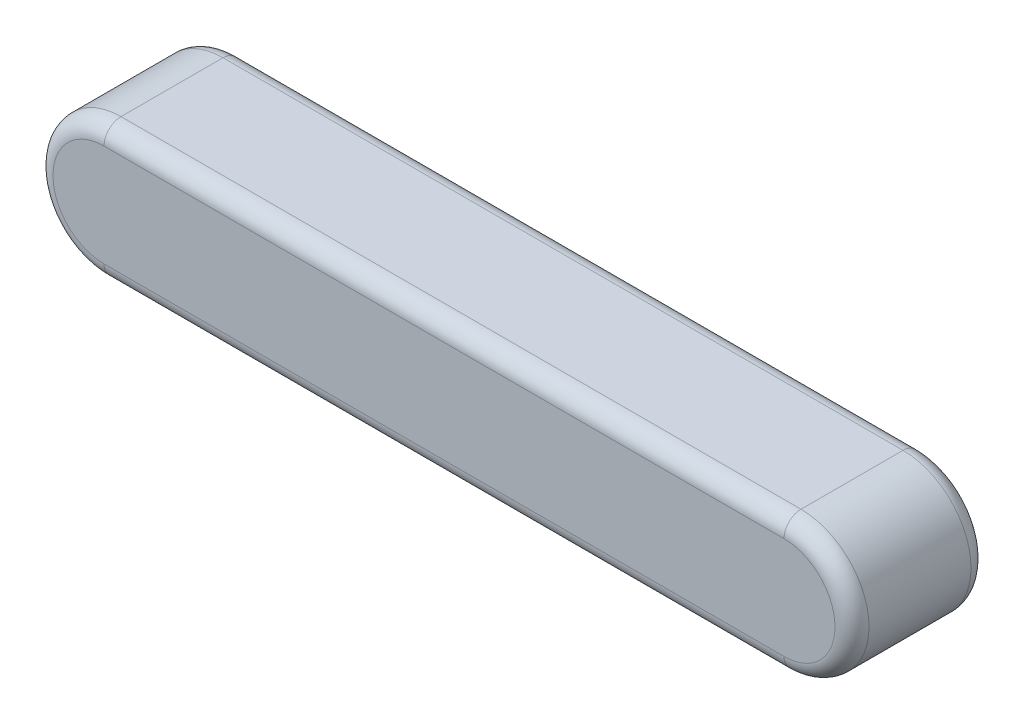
ISO-10303-21;
HEADER;
FILE_DESCRIPTION(('STEP AP214'),'2;1');
FILE_NAME('part.step','',(''),(''),'','','');
FILE_SCHEMA(('AUTOMOTIVE_DESIGN { 1 0 10303 214 1 1 1 1 }'));
ENDSEC;
DATA;
#1=APPLICATION_CONTEXT('core data for automotive mechanical design processes');
#2=APPLICATION_PROTOCOL_DEFINITION('international standard','automotive_design',2000,#1);
#3=PRODUCT_CONTEXT('',#1,'mechanical');
#4=PRODUCT('Part','Part','',(#3));
#5=PRODUCT_RELATED_PRODUCT_CATEGORY('part','',(#4));
#6=PRODUCT_DEFINITION_FORMATION('','',#4);
#7=PRODUCT_DEFINITION_CONTEXT('part definition',#1,'design');
#8=PRODUCT_DEFINITION('design','',#6,#7);
#9=PRODUCT_DEFINITION_SHAPE('','',#8);
#10=(LENGTH_UNIT() NAMED_UNIT(*) SI_UNIT(.MILLI.,.METRE.));
#11=(NAMED_UNIT(*) PLANE_ANGLE_UNIT() SI_UNIT($,.RADIAN.));
#12=(NAMED_UNIT(*) SI_UNIT($,.STERADIAN.) SOLID_ANGLE_UNIT());
#13=UNCERTAINTY_MEASURE_WITH_UNIT(LENGTH_MEASURE(1.E-05),#10,'distance_accuracy_value','');
#14=(GEOMETRIC_REPRESENTATION_CONTEXT(3) GLOBAL_UNCERTAINTY_ASSIGNED_CONTEXT((#13)) GLOBAL_UNIT_ASSIGNED_CONTEXT((#10,
#11,#12)) REPRESENTATION_CONTEXT('',''));
#15=CARTESIAN_POINT('',(0.,0.,0.));
#16=DIRECTION('',(0.,0.,1.));
#17=DIRECTION('',(1.,0.,0.));
#18=AXIS2_PLACEMENT_3D('',#15,#16,#17);
#19=CARTESIAN_POINT('',(-5.,0.,2.));
#20=DIRECTION('',(0.,0.,-1.));
#21=DIRECTION('',(-1.,0.,0.));
#22=AXIS2_PLACEMENT_3D('',#19,#20,#21);
#23=CYLINDRICAL_SURFACE('',#22,1.);
#24=DIRECTION('',(0.,0.,-1.));
#25=VECTOR('',#24,1.);
#26=CARTESIAN_POINT('',(-5.,-1.,2.));
#27=LINE('',#26,#25);
#28=CARTESIAN_POINT('',(-5.,-1.,1.75));
#29=VERTEX_POINT('',#28);
#30=CARTESIAN_POINT('',(-5.,-1.,0.25));
#31=VERTEX_POINT('',#30);
#32=EDGE_CURVE('E123',#29,#31,#27,.T.);
#33=ORIENTED_EDGE('',*,*,#32,.F.);
#34=CARTESIAN_POINT('',(-5.,0.,1.75));
#35=DIRECTION('',(0.,0.,1.));
#36=DIRECTION('',(1.,0.,0.));
#37=AXIS2_PLACEMENT_3D('',#34,#35,#36);
#38=CIRCLE('',#37,1.);
#39=CARTESIAN_POINT('',(-5.,1.,1.75));
#40=VERTEX_POINT('',#39);
#41=EDGE_CURVE('E59',#29,#40,#38,.F.);
#42=ORIENTED_EDGE('',*,*,#41,.T.);
#43=DIRECTION('',(0.,0.,-1.));
#44=VECTOR('',#43,1.);
#45=CARTESIAN_POINT('',(-5.,1.,2.));
#46=LINE('',#45,#44);
#47=CARTESIAN_POINT('',(-5.,1.,0.25));
#48=VERTEX_POINT('',#47);
#49=EDGE_CURVE('E159',#40,#48,#46,.T.);
#50=ORIENTED_EDGE('',*,*,#49,.T.);
#51=CARTESIAN_POINT('',(-5.,0.,0.25));
#52=DIRECTION('',(0.,0.,1.));
#53=DIRECTION('',(1.,0.,0.));
#54=AXIS2_PLACEMENT_3D('',#51,#52,#53);
#55=CIRCLE('',#54,1.);
#56=EDGE_CURVE('E150',#48,#31,#55,.T.);
#57=ORIENTED_EDGE('',*,*,#56,.T.);
#58=EDGE_LOOP('',(#33,#42,#50,#57));
#59=FACE_BOUND('',#58,.T.);
#60=ADVANCED_FACE('F36',(#59),#23,.T.);
#61=CARTESIAN_POINT('',(-5.,-1.,2.));
#62=DIRECTION('',(0.,1.,0.));
#63=DIRECTION('',(-1.,0.,0.));
#64=AXIS2_PLACEMENT_3D('',#61,#62,#63);
#65=PLANE('',#64);
#66=DIRECTION('',(0.,0.,-1.));
#67=VECTOR('',#66,1.);
#68=CARTESIAN_POINT('',(5.,-0.999999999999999,2.));
#69=LINE('',#68,#67);
#70=CARTESIAN_POINT('',(5.,-0.999999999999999,1.75));
#71=VERTEX_POINT('',#70);
#72=CARTESIAN_POINT('',(5.,-0.999999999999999,0.25));
#73=VERTEX_POINT('',#72);
#74=EDGE_CURVE('E192',#71,#73,#69,.T.);
#75=ORIENTED_EDGE('',*,*,#74,.F.);
#76=DIRECTION('',(1.,0.,0.));
#77=VECTOR('',#76,1.);
#78=CARTESIAN_POINT('',(-5.,-1.,1.75));
#79=LINE('',#78,#77);
#80=EDGE_CURVE('E148',#71,#29,#79,.F.);
#81=ORIENTED_EDGE('',*,*,#80,.T.);
#82=ORIENTED_EDGE('',*,*,#32,.T.);
#83=DIRECTION('',(1.,0.,0.));
#84=VECTOR('',#83,1.);
#85=CARTESIAN_POINT('',(-5.,-1.,0.25));
#86=LINE('',#85,#84);
#87=EDGE_CURVE('E146',#31,#73,#86,.T.);
#88=ORIENTED_EDGE('',*,*,#87,.T.);
#89=EDGE_LOOP('',(#75,#81,#82,#88));
#90=FACE_BOUND('',#89,.T.);
#91=ADVANCED_FACE('F206',(#90),#65,.F.);
#92=CARTESIAN_POINT('',(5.,0.,2.));
#93=DIRECTION('',(0.,0.,-1.));
#94=DIRECTION('',(-1.,0.,0.));
#95=AXIS2_PLACEMENT_3D('',#92,#93,#94);
#96=CYLINDRICAL_SURFACE('',#95,1.);
#97=DIRECTION('',(0.,0.,-1.));
#98=VECTOR('',#97,1.);
#99=CARTESIAN_POINT('',(5.,1.,2.));
#100=LINE('',#99,#98);
#101=CARTESIAN_POINT('',(5.,1.,1.75));
#102=VERTEX_POINT('',#101);
#103=CARTESIAN_POINT('',(5.,1.,0.25));
#104=VERTEX_POINT('',#103);
#105=EDGE_CURVE('E190',#102,#104,#100,.T.);
#106=ORIENTED_EDGE('',*,*,#105,.F.);
#107=CARTESIAN_POINT('',(5.,0.,1.75));
#108=DIRECTION('',(0.,0.,1.));
#109=DIRECTION('',(1.,0.,0.));
#110=AXIS2_PLACEMENT_3D('',#107,#108,#109);
#111=CIRCLE('',#110,1.);
#112=EDGE_CURVE('E110',#102,#71,#111,.F.);
#113=ORIENTED_EDGE('',*,*,#112,.T.);
#114=ORIENTED_EDGE('',*,*,#74,.T.);
#115=CARTESIAN_POINT('',(5.,0.,0.25));
#116=DIRECTION('',(0.,0.,1.));
#117=DIRECTION('',(1.,0.,0.));
#118=AXIS2_PLACEMENT_3D('',#115,#116,#117);
#119=CIRCLE('',#118,1.);
#120=EDGE_CURVE('E129',#73,#104,#119,.T.);
#121=ORIENTED_EDGE('',*,*,#120,.T.);
#122=EDGE_LOOP('',(#106,#113,#114,#121));
#123=FACE_BOUND('',#122,.T.);
#124=ADVANCED_FACE('F189',(#123),#96,.T.);
#125=CARTESIAN_POINT('',(-5.,1.,2.));
#126=DIRECTION('',(0.,-1.,0.));
#127=DIRECTION('',(1.,0.,0.));
#128=AXIS2_PLACEMENT_3D('',#125,#126,#127);
#129=PLANE('',#128);
#130=ORIENTED_EDGE('',*,*,#49,.F.);
#131=DIRECTION('',(-1.,0.,0.));
#132=VECTOR('',#131,1.);
#133=CARTESIAN_POINT('',(5.,1.,1.75));
#134=LINE('',#133,#132);
#135=EDGE_CURVE('E11',#40,#102,#134,.F.);
#136=ORIENTED_EDGE('',*,*,#135,.T.);
#137=ORIENTED_EDGE('',*,*,#105,.T.);
#138=DIRECTION('',(-1.,0.,0.));
#139=VECTOR('',#138,1.);
#140=CARTESIAN_POINT('',(-5.,1.,0.25));
#141=LINE('',#140,#139);
#142=EDGE_CURVE('E45',#104,#48,#141,.T.);
#143=ORIENTED_EDGE('',*,*,#142,.T.);
#144=EDGE_LOOP('',(#130,#136,#137,#143));
#145=FACE_BOUND('',#144,.T.);
#146=ADVANCED_FACE('F193',(#145),#129,.F.);
#147=CARTESIAN_POINT('',(-5.,0.,2.));
#148=DIRECTION('',(0.,0.,1.));
#149=DIRECTION('',(1.,0.,0.));
#150=AXIS2_PLACEMENT_3D('',#147,#148,#149);
#151=PLANE('',#150);
#152=DIRECTION('',(1.,0.,0.));
#153=VECTOR('',#152,1.);
#154=CARTESIAN_POINT('',(5.,-0.750000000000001,2.));
#155=LINE('',#154,#153);
#156=CARTESIAN_POINT('',(-5.,-0.749999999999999,2.));
#157=VERTEX_POINT('',#156);
#158=CARTESIAN_POINT('',(5.,-0.750000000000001,2.));
#159=VERTEX_POINT('',#158);
#160=EDGE_CURVE('E127',#157,#159,#155,.T.);
#161=ORIENTED_EDGE('',*,*,#160,.T.);
#162=CARTESIAN_POINT('',(5.,0.,2.));
#163=DIRECTION('',(0.,0.,1.));
#164=DIRECTION('',(1.,0.,0.));
#165=AXIS2_PLACEMENT_3D('',#162,#163,#164);
#166=CIRCLE('',#165,0.750000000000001);
#167=CARTESIAN_POINT('',(5.,0.750000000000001,2.));
#168=VERTEX_POINT('',#167);
#169=EDGE_CURVE('E108',#159,#168,#166,.T.);
#170=ORIENTED_EDGE('',*,*,#169,.T.);
#171=DIRECTION('',(-1.,0.,0.));
#172=VECTOR('',#171,1.);
#173=CARTESIAN_POINT('',(-5.,0.75,2.));
#174=LINE('',#173,#172);
#175=CARTESIAN_POINT('',(-5.,0.75,2.));
#176=VERTEX_POINT('',#175);
#177=EDGE_CURVE('E116',#168,#176,#174,.T.);
#178=ORIENTED_EDGE('',*,*,#177,.T.);
#179=CARTESIAN_POINT('',(-5.,0.,2.));
#180=DIRECTION('',(0.,0.,1.));
#181=DIRECTION('',(1.,0.,0.));
#182=AXIS2_PLACEMENT_3D('',#179,#180,#181);
#183=CIRCLE('',#182,0.75);
#184=EDGE_CURVE('E122',#176,#157,#183,.T.);
#185=ORIENTED_EDGE('',*,*,#184,.T.);
#186=EDGE_LOOP('',(#161,#170,#178,#185));
#187=FACE_BOUND('',#186,.T.);
#188=ADVANCED_FACE('F125',(#187),#151,.T.);
#189=CARTESIAN_POINT('',(-5.,0.,0.));
#190=DIRECTION('',(0.,0.,1.));
#191=DIRECTION('',(1.,0.,0.));
#192=AXIS2_PLACEMENT_3D('',#189,#190,#191);
#193=PLANE('',#192);
#194=DIRECTION('',(-1.,0.,0.));
#195=VECTOR('',#194,1.);
#196=CARTESIAN_POINT('',(-5.,0.75,0.));
#197=LINE('',#196,#195);
#198=CARTESIAN_POINT('',(-5.,0.750000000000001,0.));
#199=VERTEX_POINT('',#198);
#200=CARTESIAN_POINT('',(5.,0.750000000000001,0.));
#201=VERTEX_POINT('',#200);
#202=EDGE_CURVE('E141',#199,#201,#197,.F.);
#203=ORIENTED_EDGE('',*,*,#202,.T.);
#204=CARTESIAN_POINT('',(5.,0.,0.));
#205=DIRECTION('',(0.,0.,1.));
#206=DIRECTION('',(1.,0.,0.));
#207=AXIS2_PLACEMENT_3D('',#204,#205,#206);
#208=CIRCLE('',#207,0.750000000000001);
#209=CARTESIAN_POINT('',(5.,-0.750000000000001,0.));
#210=VERTEX_POINT('',#209);
#211=EDGE_CURVE('E143',#201,#210,#208,.F.);
#212=ORIENTED_EDGE('',*,*,#211,.T.);
#213=DIRECTION('',(1.,0.,0.));
#214=VECTOR('',#213,1.);
#215=CARTESIAN_POINT('',(-5.,-0.75,0.));
#216=LINE('',#215,#214);
#217=CARTESIAN_POINT('',(-5.,-0.75,0.));
#218=VERTEX_POINT('',#217);
#219=EDGE_CURVE('E137',#210,#218,#216,.F.);
#220=ORIENTED_EDGE('',*,*,#219,.T.);
#221=CARTESIAN_POINT('',(-5.,0.,0.));
#222=DIRECTION('',(0.,0.,1.));
#223=DIRECTION('',(1.,0.,0.));
#224=AXIS2_PLACEMENT_3D('',#221,#222,#223);
#225=CIRCLE('',#224,0.75);
#226=EDGE_CURVE('E139',#218,#199,#225,.F.);
#227=ORIENTED_EDGE('',*,*,#226,.T.);
#228=EDGE_LOOP('',(#203,#212,#220,#227));
#229=FACE_BOUND('',#228,.T.);
#230=ADVANCED_FACE('F179',(#229),#193,.F.);
#231=CARTESIAN_POINT('',(-5.,0.,1.75));
#232=DIRECTION('',(0.,0.,1.));
#233=DIRECTION('',(1.,0.,0.));
#234=AXIS2_PLACEMENT_3D('',#231,#232,#233);
#235=TOROIDAL_SURFACE('',#234,0.75,0.25);
#236=CARTESIAN_POINT('',(-5.,0.750000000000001,1.75));
#237=DIRECTION('',(1.,0.,0.));
#238=DIRECTION('',(0.,0.,-1.));
#239=AXIS2_PLACEMENT_3D('',#236,#237,#238);
#240=CIRCLE('',#239,0.25);
#241=EDGE_CURVE('E119',#40,#176,#240,.T.);
#242=ORIENTED_EDGE('',*,*,#241,.F.);
#243=ORIENTED_EDGE('',*,*,#41,.F.);
#244=CARTESIAN_POINT('',(-5.,-0.749999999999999,1.75));
#245=DIRECTION('',(1.,0.,0.));
#246=DIRECTION('',(0.,0.,-1.));
#247=AXIS2_PLACEMENT_3D('',#244,#245,#246);
#248=CIRCLE('',#247,0.25);
#249=EDGE_CURVE('E156',#157,#29,#248,.T.);
#250=ORIENTED_EDGE('',*,*,#249,.F.);
#251=ORIENTED_EDGE('',*,*,#184,.F.);
#252=EDGE_LOOP('',(#242,#243,#250,#251));
#253=FACE_BOUND('',#252,.T.);
#254=ADVANCED_FACE('F201',(#253),#235,.T.);
#255=CARTESIAN_POINT('',(-5.,-0.75,1.75));
#256=DIRECTION('',(-1.,0.,0.));
#257=DIRECTION('',(0.,-1.,0.));
#258=AXIS2_PLACEMENT_3D('',#255,#256,#257);
#259=CYLINDRICAL_SURFACE('',#258,0.25);
#260=ORIENTED_EDGE('',*,*,#249,.T.);
#261=ORIENTED_EDGE('',*,*,#80,.F.);
#262=CARTESIAN_POINT('',(5.,-0.750000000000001,1.75));
#263=DIRECTION('',(1.,0.,0.));
#264=DIRECTION('',(0.,0.,-1.));
#265=AXIS2_PLACEMENT_3D('',#262,#263,#264);
#266=CIRCLE('',#265,0.25);
#267=EDGE_CURVE('E113',#159,#71,#266,.T.);
#268=ORIENTED_EDGE('',*,*,#267,.F.);
#269=ORIENTED_EDGE('',*,*,#160,.F.);
#270=EDGE_LOOP('',(#260,#261,#268,#269));
#271=FACE_BOUND('',#270,.T.);
#272=ADVANCED_FACE('F204',(#271),#259,.T.);
#273=CARTESIAN_POINT('',(-5.,0.75,1.75));
#274=DIRECTION('',(1.,0.,0.));
#275=DIRECTION('',(0.,1.,0.));
#276=AXIS2_PLACEMENT_3D('',#273,#274,#275);
#277=CYLINDRICAL_SURFACE('',#276,0.25);
#278=ORIENTED_EDGE('',*,*,#241,.T.);
#279=ORIENTED_EDGE('',*,*,#177,.F.);
#280=CARTESIAN_POINT('',(5.,0.750000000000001,1.75));
#281=DIRECTION('',(1.,0.,0.));
#282=DIRECTION('',(0.,0.,-1.));
#283=AXIS2_PLACEMENT_3D('',#280,#281,#282);
#284=CIRCLE('',#283,0.25);
#285=EDGE_CURVE('E104',#102,#168,#284,.T.);
#286=ORIENTED_EDGE('',*,*,#285,.F.);
#287=ORIENTED_EDGE('',*,*,#135,.F.);
#288=EDGE_LOOP('',(#278,#279,#286,#287));
#289=FACE_BOUND('',#288,.T.);
#290=ADVANCED_FACE('F117',(#289),#277,.T.);
#291=CARTESIAN_POINT('',(5.,0.,1.75));
#292=DIRECTION('',(0.,0.,1.));
#293=DIRECTION('',(1.,0.,0.));
#294=AXIS2_PLACEMENT_3D('',#291,#292,#293);
#295=TOROIDAL_SURFACE('',#294,0.750000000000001,0.25);
#296=ORIENTED_EDGE('',*,*,#267,.T.);
#297=ORIENTED_EDGE('',*,*,#112,.F.);
#298=ORIENTED_EDGE('',*,*,#285,.T.);
#299=ORIENTED_EDGE('',*,*,#169,.F.);
#300=EDGE_LOOP('',(#296,#297,#298,#299));
#301=FACE_BOUND('',#300,.T.);
#302=ADVANCED_FACE('F106',(#301),#295,.T.);
#303=CARTESIAN_POINT('',(-5.,0.,0.25));
#304=DIRECTION('',(0.,0.,1.));
#305=DIRECTION('',(1.,0.,0.));
#306=AXIS2_PLACEMENT_3D('',#303,#304,#305);
#307=TOROIDAL_SURFACE('',#306,0.75,0.25);
#308=CARTESIAN_POINT('',(-5.,0.750000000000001,0.25));
#309=DIRECTION('',(1.,0.,0.));
#310=DIRECTION('',(0.,0.,-1.));
#311=AXIS2_PLACEMENT_3D('',#308,#309,#310);
#312=CIRCLE('',#311,0.25);
#313=EDGE_CURVE('E163',#199,#48,#312,.T.);
#314=ORIENTED_EDGE('',*,*,#313,.F.);
#315=ORIENTED_EDGE('',*,*,#226,.F.);
#316=CARTESIAN_POINT('',(-5.,-0.749999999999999,0.25));
#317=DIRECTION('',(1.,0.,0.));
#318=DIRECTION('',(0.,0.,-1.));
#319=AXIS2_PLACEMENT_3D('',#316,#317,#318);
#320=CIRCLE('',#319,0.25);
#321=EDGE_CURVE('E40',#31,#218,#320,.T.);
#322=ORIENTED_EDGE('',*,*,#321,.F.);
#323=ORIENTED_EDGE('',*,*,#56,.F.);
#324=EDGE_LOOP('',(#314,#315,#322,#323));
#325=FACE_BOUND('',#324,.T.);
#326=ADVANCED_FACE('F38',(#325),#307,.T.);
#327=CARTESIAN_POINT('',(-5.,-0.75,0.25));
#328=DIRECTION('',(1.,0.,0.));
#329=DIRECTION('',(0.,1.,0.));
#330=AXIS2_PLACEMENT_3D('',#327,#328,#329);
#331=CYLINDRICAL_SURFACE('',#330,0.25);
#332=ORIENTED_EDGE('',*,*,#321,.T.);
#333=ORIENTED_EDGE('',*,*,#219,.F.);
#334=CARTESIAN_POINT('',(5.,-0.750000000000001,0.25));
#335=DIRECTION('',(1.,0.,0.));
#336=DIRECTION('',(0.,0.,-1.));
#337=AXIS2_PLACEMENT_3D('',#334,#335,#336);
#338=CIRCLE('',#337,0.25);
#339=EDGE_CURVE('E162',#73,#210,#338,.T.);
#340=ORIENTED_EDGE('',*,*,#339,.F.);
#341=ORIENTED_EDGE('',*,*,#87,.F.);
#342=EDGE_LOOP('',(#332,#333,#340,#341));
#343=FACE_BOUND('',#342,.T.);
#344=ADVANCED_FACE('F173',(#343),#331,.T.);
#345=CARTESIAN_POINT('',(-5.,0.75,0.25));
#346=DIRECTION('',(-1.,0.,0.));
#347=DIRECTION('',(0.,-1.,0.));
#348=AXIS2_PLACEMENT_3D('',#345,#346,#347);
#349=CYLINDRICAL_SURFACE('',#348,0.25);
#350=ORIENTED_EDGE('',*,*,#313,.T.);
#351=ORIENTED_EDGE('',*,*,#142,.F.);
#352=CARTESIAN_POINT('',(5.,0.750000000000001,0.25));
#353=DIRECTION('',(1.,0.,0.));
#354=DIRECTION('',(0.,0.,-1.));
#355=AXIS2_PLACEMENT_3D('',#352,#353,#354);
#356=CIRCLE('',#355,0.25);
#357=EDGE_CURVE('E160',#201,#104,#356,.T.);
#358=ORIENTED_EDGE('',*,*,#357,.F.);
#359=ORIENTED_EDGE('',*,*,#202,.F.);
#360=EDGE_LOOP('',(#350,#351,#358,#359));
#361=FACE_BOUND('',#360,.T.);
#362=ADVANCED_FACE('F185',(#361),#349,.T.);
#363=CARTESIAN_POINT('',(5.,0.,0.25));
#364=DIRECTION('',(0.,0.,1.));
#365=DIRECTION('',(1.,0.,0.));
#366=AXIS2_PLACEMENT_3D('',#363,#364,#365);
#367=TOROIDAL_SURFACE('',#366,0.750000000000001,0.25);
#368=ORIENTED_EDGE('',*,*,#339,.T.);
#369=ORIENTED_EDGE('',*,*,#211,.F.);
#370=ORIENTED_EDGE('',*,*,#357,.T.);
#371=ORIENTED_EDGE('',*,*,#120,.F.);
#372=EDGE_LOOP('',(#368,#369,#370,#371));
#373=FACE_BOUND('',#372,.T.);
#374=ADVANCED_FACE('F183',(#373),#367,.T.);
#375=CLOSED_SHELL('',(#60,#91,#124,#146,#188,#230,#254,#272,#290,#302,#326,#344,#362,#374));
#376=MANIFOLD_SOLID_BREP('B2',#375);
#377=ADVANCED_BREP_SHAPE_REPRESENTATION('',(#18,#376),#14);
#378=SHAPE_DEFINITION_REPRESENTATION(#9,#377);
ENDSEC;
END-ISO-10303-21;
